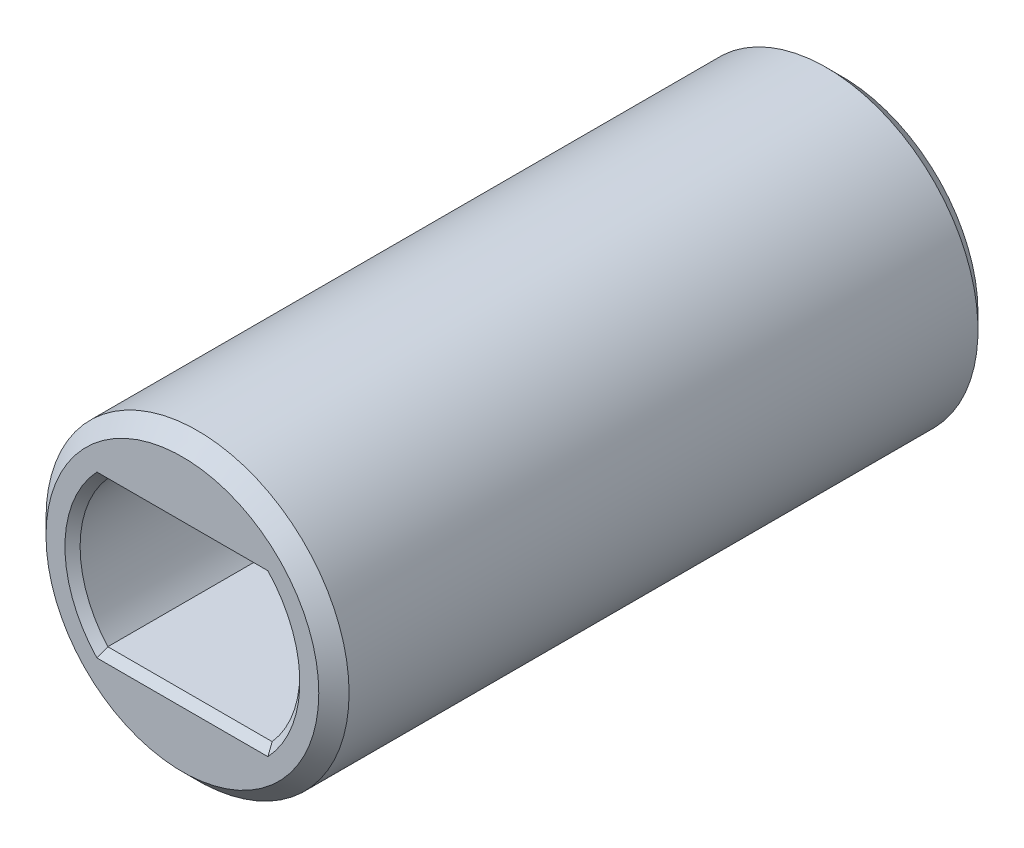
ISO-10303-21;
HEADER;
FILE_DESCRIPTION(('STEP AP214'),'2;1');
FILE_NAME('part.step','',(''),(''),'','','');
FILE_SCHEMA(('AUTOMOTIVE_DESIGN { 1 0 10303 214 1 1 1 1 }'));
ENDSEC;
DATA;
#1=APPLICATION_CONTEXT('core data for automotive mechanical design processes');
#2=APPLICATION_PROTOCOL_DEFINITION('international standard','automotive_design',2000,#1);
#3=PRODUCT_CONTEXT('',#1,'mechanical');
#4=PRODUCT('Part','Part','',(#3));
#5=PRODUCT_RELATED_PRODUCT_CATEGORY('part','',(#4));
#6=PRODUCT_DEFINITION_FORMATION('','',#4);
#7=PRODUCT_DEFINITION_CONTEXT('part definition',#1,'design');
#8=PRODUCT_DEFINITION('design','',#6,#7);
#9=PRODUCT_DEFINITION_SHAPE('','',#8);
#10=(LENGTH_UNIT() NAMED_UNIT(*) SI_UNIT(.MILLI.,.METRE.));
#11=(NAMED_UNIT(*) PLANE_ANGLE_UNIT() SI_UNIT($,.RADIAN.));
#12=(NAMED_UNIT(*) SI_UNIT($,.STERADIAN.) SOLID_ANGLE_UNIT());
#13=UNCERTAINTY_MEASURE_WITH_UNIT(LENGTH_MEASURE(1.E-05),#10,'distance_accuracy_value','');
#14=(GEOMETRIC_REPRESENTATION_CONTEXT(3) GLOBAL_UNCERTAINTY_ASSIGNED_CONTEXT((#13)) GLOBAL_UNIT_ASSIGNED_CONTEXT((#10,
#11,#12)) REPRESENTATION_CONTEXT('',''));
#15=CARTESIAN_POINT('',(0.,0.,0.));
#16=DIRECTION('',(0.,0.,1.));
#17=DIRECTION('',(1.,0.,0.));
#18=AXIS2_PLACEMENT_3D('',#15,#16,#17);
#19=CARTESIAN_POINT('',(0.,0.,-0.999999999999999));
#20=DIRECTION('',(0.,0.,-1.));
#21=DIRECTION('',(-1.,0.,0.));
#22=AXIS2_PLACEMENT_3D('',#19,#20,#21);
#23=CYLINDRICAL_SURFACE('',#22,3.);
#24=CARTESIAN_POINT('',(0.,0.,-8.8));
#25=DIRECTION('',(0.,0.,-1.));
#26=DIRECTION('',(-1.,0.,0.));
#27=AXIS2_PLACEMENT_3D('',#24,#25,#26);
#28=CIRCLE('',#27,3.);
#29=CARTESIAN_POINT('',(-3.,0.,-8.8));
#30=VERTEX_POINT('',#29);
#31=EDGE_CURVE('E209',#30,#30,#28,.T.);
#32=ORIENTED_EDGE('',*,*,#31,.T.);
#33=EDGE_LOOP('',(#32));
#34=FACE_BOUND('',#33,.T.);
#35=DIRECTION('',(0.,0.,-1.));
#36=VECTOR('',#35,1.);
#37=CARTESIAN_POINT('',(-0.4,-2.9732137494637,-0.999999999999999));
#38=LINE('',#37,#36);
#39=CARTESIAN_POINT('',(-0.4,-2.9732137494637,-6.8));
#40=VERTEX_POINT('',#39);
#41=CARTESIAN_POINT('',(-0.4,-2.9732137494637,-0.999999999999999));
#42=VERTEX_POINT('',#41);
#43=EDGE_CURVE('E151',#40,#42,#38,.F.);
#44=ORIENTED_EDGE('',*,*,#43,.F.);
#45=CARTESIAN_POINT('',(0.,0.,-7.2));
#46=DIRECTION('',(0.707106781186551,0.,0.707106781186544));
#47=DIRECTION('',(0.707106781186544,0.,-0.707106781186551));
#48=AXIS2_PLACEMENT_3D('',#45,#46,#47);
#49=ELLIPSE('',#48,4.2426406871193,3.);
#50=CARTESIAN_POINT('',(-0.200000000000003,-2.99332590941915,-7.));
#51=VERTEX_POINT('',#50);
#52=EDGE_CURVE('E188',#40,#51,#49,.T.);
#53=ORIENTED_EDGE('',*,*,#52,.T.);
#54=CARTESIAN_POINT('',(0.,0.,-7.));
#55=DIRECTION('',(0.,0.,1.));
#56=DIRECTION('',(1.,0.,0.));
#57=AXIS2_PLACEMENT_3D('',#54,#55,#56);
#58=CIRCLE('',#57,3.);
#59=CARTESIAN_POINT('',(0.200000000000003,-2.99332590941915,-7.));
#60=VERTEX_POINT('',#59);
#61=EDGE_CURVE('E175',#60,#51,#58,.F.);
#62=ORIENTED_EDGE('',*,*,#61,.F.);
#63=CARTESIAN_POINT('',(0.,0.,-7.2));
#64=DIRECTION('',(-0.707106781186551,0.,0.707106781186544));
#65=DIRECTION('',(-0.707106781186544,0.,-0.707106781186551));
#66=AXIS2_PLACEMENT_3D('',#63,#64,#65);
#67=ELLIPSE('',#66,4.2426406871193,3.);
#68=CARTESIAN_POINT('',(0.4,-2.9732137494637,-6.8));
#69=VERTEX_POINT('',#68);
#70=EDGE_CURVE('E140',#60,#69,#67,.T.);
#71=ORIENTED_EDGE('',*,*,#70,.T.);
#72=DIRECTION('',(0.,0.,-1.));
#73=VECTOR('',#72,1.);
#74=CARTESIAN_POINT('',(0.4,-2.9732137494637,-0.999999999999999));
#75=LINE('',#74,#73);
#76=CARTESIAN_POINT('',(0.4,-2.9732137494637,-0.999999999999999));
#77=VERTEX_POINT('',#76);
#78=EDGE_CURVE('E126',#77,#69,#75,.T.);
#79=ORIENTED_EDGE('',*,*,#78,.F.);
#80=CARTESIAN_POINT('',(0.,0.,-0.999999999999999));
#81=DIRECTION('',(0.,0.,-1.));
#82=DIRECTION('',(-1.,0.,0.));
#83=AXIS2_PLACEMENT_3D('',#80,#81,#82);
#84=CIRCLE('',#83,3.);
#85=CARTESIAN_POINT('',(0.4,2.9732137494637,-0.999999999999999));
#86=VERTEX_POINT('',#85);
#87=EDGE_CURVE('E138',#86,#77,#84,.T.);
#88=ORIENTED_EDGE('',*,*,#87,.F.);
#89=DIRECTION('',(0.,0.,-1.));
#90=VECTOR('',#89,1.);
#91=CARTESIAN_POINT('',(0.4,2.9732137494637,-0.999999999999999));
#92=LINE('',#91,#90);
#93=CARTESIAN_POINT('',(0.4,2.9732137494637,-6.8));
#94=VERTEX_POINT('',#93);
#95=EDGE_CURVE('E129',#94,#86,#92,.F.);
#96=ORIENTED_EDGE('',*,*,#95,.F.);
#97=CARTESIAN_POINT('',(0.,0.,-7.2));
#98=DIRECTION('',(-0.707106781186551,0.,0.707106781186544));
#99=DIRECTION('',(-0.707106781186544,0.,-0.707106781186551));
#100=AXIS2_PLACEMENT_3D('',#97,#98,#99);
#101=ELLIPSE('',#100,4.2426406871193,3.);
#102=CARTESIAN_POINT('',(0.200000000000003,2.99332590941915,-7.));
#103=VERTEX_POINT('',#102);
#104=EDGE_CURVE('E191',#94,#103,#101,.T.);
#105=ORIENTED_EDGE('',*,*,#104,.T.);
#106=CARTESIAN_POINT('',(-0.200000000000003,2.99332590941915,-7.));
#107=VERTEX_POINT('',#106);
#108=EDGE_CURVE('E172',#107,#103,#58,.F.);
#109=ORIENTED_EDGE('',*,*,#108,.F.);
#110=CARTESIAN_POINT('',(0.,0.,-7.2));
#111=DIRECTION('',(0.707106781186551,0.,0.707106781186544));
#112=DIRECTION('',(0.707106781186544,0.,-0.707106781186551));
#113=AXIS2_PLACEMENT_3D('',#110,#111,#112);
#114=ELLIPSE('',#113,4.2426406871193,3.);
#115=CARTESIAN_POINT('',(-0.4,2.9732137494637,-6.8));
#116=VERTEX_POINT('',#115);
#117=EDGE_CURVE('E186',#107,#116,#114,.T.);
#118=ORIENTED_EDGE('',*,*,#117,.T.);
#119=DIRECTION('',(0.,0.,-1.));
#120=VECTOR('',#119,1.);
#121=CARTESIAN_POINT('',(-0.4,2.9732137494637,-0.999999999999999));
#122=LINE('',#121,#120);
#123=CARTESIAN_POINT('',(-0.4,2.9732137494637,-0.999999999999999));
#124=VERTEX_POINT('',#123);
#125=EDGE_CURVE('E329',#124,#116,#122,.T.);
#126=ORIENTED_EDGE('',*,*,#125,.F.);
#127=EDGE_CURVE('E145',#42,#124,#84,.T.);
#128=ORIENTED_EDGE('',*,*,#127,.F.);
#129=EDGE_LOOP('',(#44,#53,#62,#71,#79,#88,#96,#105,#109,#118,#126,#128));
#130=FACE_BOUND('',#129,.T.);
#131=ADVANCED_FACE('F33',(#34,#130),#23,.F.);
#132=CARTESIAN_POINT('',(0.,0.,-0.999999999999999));
#133=DIRECTION('',(0.,0.,-1.));
#134=DIRECTION('',(-1.,0.,0.));
#135=AXIS2_PLACEMENT_3D('',#132,#133,#134);
#136=PLANE('',#135);
#137=ORIENTED_EDGE('',*,*,#127,.T.);
#138=DIRECTION('',(0.,-1.,0.));
#139=VECTOR('',#138,1.);
#140=CARTESIAN_POINT('',(-0.4,0.,-0.999999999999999));
#141=LINE('',#140,#139);
#142=EDGE_CURVE('E133',#124,#42,#141,.T.);
#143=ORIENTED_EDGE('',*,*,#142,.T.);
#144=EDGE_LOOP('',(#137,#143));
#145=FACE_BOUND('',#144,.T.);
#146=ADVANCED_FACE('F270',(#145),#136,.T.);
#147=ORIENTED_EDGE('',*,*,#87,.T.);
#148=DIRECTION('',(0.,1.,0.));
#149=VECTOR('',#148,1.);
#150=CARTESIAN_POINT('',(0.4,0.,-0.999999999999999));
#151=LINE('',#150,#149);
#152=EDGE_CURVE('E123',#77,#86,#151,.T.);
#153=ORIENTED_EDGE('',*,*,#152,.T.);
#154=EDGE_LOOP('',(#147,#153));
#155=FACE_BOUND('',#154,.T.);
#156=ADVANCED_FACE('F143',(#155),#136,.T.);
#157=CARTESIAN_POINT('',(0.,0.,8.4));
#158=DIRECTION('',(0.,0.,1.));
#159=DIRECTION('',(1.,0.,0.));
#160=AXIS2_PLACEMENT_3D('',#157,#158,#159);
#161=PLANE('',#160);
#162=CARTESIAN_POINT('',(0.,0.,8.4));
#163=DIRECTION('',(0.,0.,1.));
#164=DIRECTION('',(1.,0.,0.));
#165=AXIS2_PLACEMENT_3D('',#162,#163,#164);
#166=CIRCLE('',#165,3.60000000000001);
#167=CARTESIAN_POINT('',(3.60000000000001,0.,8.4));
#168=VERTEX_POINT('',#167);
#169=EDGE_CURVE('E11',#168,#168,#166,.T.);
#170=ORIENTED_EDGE('',*,*,#169,.T.);
#171=EDGE_LOOP('',(#170));
#172=FACE_BOUND('',#171,.T.);
#173=DIRECTION('',(1.,0.,0.));
#174=VECTOR('',#173,1.);
#175=CARTESIAN_POINT('',(0.,2.125,8.4));
#176=LINE('',#175,#174);
#177=CARTESIAN_POINT('',(-2.25707221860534,2.125,8.4));
#178=VERTEX_POINT('',#177);
#179=CARTESIAN_POINT('',(2.25707221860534,2.125,8.4));
#180=VERTEX_POINT('',#179);
#181=EDGE_CURVE('E198',#178,#180,#176,.T.);
#182=ORIENTED_EDGE('',*,*,#181,.T.);
#183=CARTESIAN_POINT('',(0.,0.,8.4));
#184=DIRECTION('',(0.,0.,1.));
#185=DIRECTION('',(1.,0.,0.));
#186=AXIS2_PLACEMENT_3D('',#183,#184,#185);
#187=CIRCLE('',#186,3.1);
#188=CARTESIAN_POINT('',(2.25707221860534,-2.125,8.4));
#189=VERTEX_POINT('',#188);
#190=EDGE_CURVE('E202',#180,#189,#187,.F.);
#191=ORIENTED_EDGE('',*,*,#190,.T.);
#192=DIRECTION('',(-1.,0.,0.));
#193=VECTOR('',#192,1.);
#194=CARTESIAN_POINT('',(0.,-2.125,8.4));
#195=LINE('',#194,#193);
#196=CARTESIAN_POINT('',(-2.25707221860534,-2.125,8.4));
#197=VERTEX_POINT('',#196);
#198=EDGE_CURVE('E200',#189,#197,#195,.T.);
#199=ORIENTED_EDGE('',*,*,#198,.T.);
#200=CARTESIAN_POINT('',(0.,0.,8.4));
#201=DIRECTION('',(0.,0.,1.));
#202=DIRECTION('',(1.,0.,0.));
#203=AXIS2_PLACEMENT_3D('',#200,#201,#202);
#204=CIRCLE('',#203,3.1);
#205=EDGE_CURVE('E196',#197,#178,#204,.F.);
#206=ORIENTED_EDGE('',*,*,#205,.T.);
#207=EDGE_LOOP('',(#182,#191,#199,#206));
#208=FACE_BOUND('',#207,.T.);
#209=ADVANCED_FACE('F304',(#172,#208),#161,.T.);
#210=CARTESIAN_POINT('',(0.,0.,8.4));
#211=DIRECTION('',(0.,0.,-1.));
#212=DIRECTION('',(-1.,0.,0.));
#213=AXIS2_PLACEMENT_3D('',#210,#211,#212);
#214=CYLINDRICAL_SURFACE('',#213,4.);
#215=CARTESIAN_POINT('',(0.,0.,-8.6));
#216=DIRECTION('',(0.,0.,-1.));
#217=DIRECTION('',(-1.,0.,0.));
#218=AXIS2_PLACEMENT_3D('',#215,#216,#217);
#219=CIRCLE('',#218,4.);
#220=CARTESIAN_POINT('',(-4.,0.,-8.6));
#221=VERTEX_POINT('',#220);
#222=EDGE_CURVE('E41',#221,#221,#219,.F.);
#223=ORIENTED_EDGE('',*,*,#222,.T.);
#224=EDGE_LOOP('',(#223));
#225=FACE_BOUND('',#224,.T.);
#226=CARTESIAN_POINT('',(0.,0.,8.00000000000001));
#227=DIRECTION('',(0.,0.,1.));
#228=DIRECTION('',(1.,0.,0.));
#229=AXIS2_PLACEMENT_3D('',#226,#227,#228);
#230=CIRCLE('',#229,4.);
#231=CARTESIAN_POINT('',(4.,0.,8.00000000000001));
#232=VERTEX_POINT('',#231);
#233=EDGE_CURVE('E499',#232,#232,#230,.F.);
#234=ORIENTED_EDGE('',*,*,#233,.T.);
#235=EDGE_LOOP('',(#234));
#236=FACE_BOUND('',#235,.T.);
#237=ADVANCED_FACE('F303',(#225,#236),#214,.T.);
#238=CARTESIAN_POINT('',(0.,0.,8.4));
#239=DIRECTION('',(0.,0.,-1.));
#240=DIRECTION('',(-1.,0.,0.));
#241=AXIS2_PLACEMENT_3D('',#238,#239,#240);
#242=CYLINDRICAL_SURFACE('',#241,2.9);
#243=DIRECTION('',(0.,0.,-1.));
#244=VECTOR('',#243,1.);
#245=CARTESIAN_POINT('',(-2.1689571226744,1.925,8.4));
#246=LINE('',#245,#244);
#247=CARTESIAN_POINT('',(-2.1689571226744,1.925,8.2));
#248=VERTEX_POINT('',#247);
#249=CARTESIAN_POINT('',(-2.1689571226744,1.925,0.));
#250=VERTEX_POINT('',#249);
#251=EDGE_CURVE('E163',#248,#250,#246,.T.);
#252=ORIENTED_EDGE('',*,*,#251,.F.);
#253=CARTESIAN_POINT('',(0.,0.,8.2));
#254=DIRECTION('',(0.,0.,1.));
#255=DIRECTION('',(1.,0.,0.));
#256=AXIS2_PLACEMENT_3D('',#253,#254,#255);
#257=CIRCLE('',#256,2.9);
#258=CARTESIAN_POINT('',(-2.1689571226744,-1.925,8.2));
#259=VERTEX_POINT('',#258);
#260=EDGE_CURVE('E55',#248,#259,#257,.T.);
#261=ORIENTED_EDGE('',*,*,#260,.T.);
#262=DIRECTION('',(0.,0.,-1.));
#263=VECTOR('',#262,1.);
#264=CARTESIAN_POINT('',(-2.1689571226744,-1.925,8.4));
#265=LINE('',#264,#263);
#266=CARTESIAN_POINT('',(-2.1689571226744,-1.925,0.));
#267=VERTEX_POINT('',#266);
#268=EDGE_CURVE('E134',#259,#267,#265,.T.);
#269=ORIENTED_EDGE('',*,*,#268,.T.);
#270=CARTESIAN_POINT('',(0.,0.,0.));
#271=DIRECTION('',(0.,0.,1.));
#272=DIRECTION('',(1.,0.,0.));
#273=AXIS2_PLACEMENT_3D('',#270,#271,#272);
#274=CIRCLE('',#273,2.9);
#275=EDGE_CURVE('E144',#250,#267,#274,.T.);
#276=ORIENTED_EDGE('',*,*,#275,.F.);
#277=EDGE_LOOP('',(#252,#261,#269,#276));
#278=FACE_BOUND('',#277,.T.);
#279=ADVANCED_FACE('F299',(#278),#242,.F.);
#280=CARTESIAN_POINT('',(-2.1689571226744,-1.925,8.4));
#281=DIRECTION('',(0.,1.,0.));
#282=DIRECTION('',(-1.,0.,0.));
#283=AXIS2_PLACEMENT_3D('',#280,#281,#282);
#284=PLANE('',#283);
#285=ORIENTED_EDGE('',*,*,#268,.F.);
#286=DIRECTION('',(1.,0.,0.));
#287=VECTOR('',#286,1.);
#288=CARTESIAN_POINT('',(-2.1689571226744,-1.925,8.2));
#289=LINE('',#288,#287);
#290=CARTESIAN_POINT('',(2.1689571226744,-1.925,8.2));
#291=VERTEX_POINT('',#290);
#292=EDGE_CURVE('E205',#259,#291,#289,.T.);
#293=ORIENTED_EDGE('',*,*,#292,.T.);
#294=DIRECTION('',(0.,0.,-1.));
#295=VECTOR('',#294,1.);
#296=CARTESIAN_POINT('',(2.1689571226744,-1.925,8.4));
#297=LINE('',#296,#295);
#298=CARTESIAN_POINT('',(2.1689571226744,-1.925,0.));
#299=VERTEX_POINT('',#298);
#300=EDGE_CURVE('E167',#291,#299,#297,.T.);
#301=ORIENTED_EDGE('',*,*,#300,.T.);
#302=DIRECTION('',(1.,0.,0.));
#303=VECTOR('',#302,1.);
#304=CARTESIAN_POINT('',(-2.1689571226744,-1.925,0.));
#305=LINE('',#304,#303);
#306=EDGE_CURVE('E148',#267,#299,#305,.T.);
#307=ORIENTED_EDGE('',*,*,#306,.F.);
#308=EDGE_LOOP('',(#285,#293,#301,#307));
#309=FACE_BOUND('',#308,.T.);
#310=ADVANCED_FACE('F295',(#309),#284,.T.);
#311=CARTESIAN_POINT('',(0.,0.,8.4));
#312=DIRECTION('',(0.,0.,-1.));
#313=DIRECTION('',(-1.,0.,0.));
#314=AXIS2_PLACEMENT_3D('',#311,#312,#313);
#315=CYLINDRICAL_SURFACE('',#314,2.9);
#316=ORIENTED_EDGE('',*,*,#300,.F.);
#317=CARTESIAN_POINT('',(0.,0.,8.2));
#318=DIRECTION('',(0.,0.,1.));
#319=DIRECTION('',(1.,0.,0.));
#320=AXIS2_PLACEMENT_3D('',#317,#318,#319);
#321=CIRCLE('',#320,2.9);
#322=CARTESIAN_POINT('',(2.1689571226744,1.925,8.2));
#323=VERTEX_POINT('',#322);
#324=EDGE_CURVE('E193',#291,#323,#321,.T.);
#325=ORIENTED_EDGE('',*,*,#324,.T.);
#326=DIRECTION('',(0.,0.,-1.));
#327=VECTOR('',#326,1.);
#328=CARTESIAN_POINT('',(2.1689571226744,1.925,8.4));
#329=LINE('',#328,#327);
#330=CARTESIAN_POINT('',(2.1689571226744,1.925,0.));
#331=VERTEX_POINT('',#330);
#332=EDGE_CURVE('E165',#323,#331,#329,.T.);
#333=ORIENTED_EDGE('',*,*,#332,.T.);
#334=CARTESIAN_POINT('',(0.,0.,0.));
#335=DIRECTION('',(0.,0.,1.));
#336=DIRECTION('',(1.,0.,0.));
#337=AXIS2_PLACEMENT_3D('',#334,#335,#336);
#338=CIRCLE('',#337,2.9);
#339=EDGE_CURVE('E157',#299,#331,#338,.T.);
#340=ORIENTED_EDGE('',*,*,#339,.F.);
#341=EDGE_LOOP('',(#316,#325,#333,#340));
#342=FACE_BOUND('',#341,.T.);
#343=ADVANCED_FACE('F292',(#342),#315,.F.);
#344=CARTESIAN_POINT('',(-2.1689571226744,1.925,8.4));
#345=DIRECTION('',(0.,-1.,0.));
#346=DIRECTION('',(1.,0.,0.));
#347=AXIS2_PLACEMENT_3D('',#344,#345,#346);
#348=PLANE('',#347);
#349=ORIENTED_EDGE('',*,*,#332,.F.);
#350=DIRECTION('',(-1.,0.,0.));
#351=VECTOR('',#350,1.);
#352=CARTESIAN_POINT('',(-2.1689571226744,1.925,8.2));
#353=LINE('',#352,#351);
#354=EDGE_CURVE('E48',#323,#248,#353,.T.);
#355=ORIENTED_EDGE('',*,*,#354,.T.);
#356=ORIENTED_EDGE('',*,*,#251,.T.);
#357=DIRECTION('',(-1.,0.,0.));
#358=VECTOR('',#357,1.);
#359=CARTESIAN_POINT('',(-2.1689571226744,1.925,0.));
#360=LINE('',#359,#358);
#361=EDGE_CURVE('E160',#331,#250,#360,.T.);
#362=ORIENTED_EDGE('',*,*,#361,.F.);
#363=EDGE_LOOP('',(#349,#355,#356,#362));
#364=FACE_BOUND('',#363,.T.);
#365=ADVANCED_FACE('F288',(#364),#348,.T.);
#366=CARTESIAN_POINT('',(0.,0.,0.));
#367=DIRECTION('',(0.,0.,-1.));
#368=DIRECTION('',(-1.,0.,0.));
#369=AXIS2_PLACEMENT_3D('',#366,#367,#368);
#370=PLANE('',#369);
#371=ORIENTED_EDGE('',*,*,#275,.T.);
#372=ORIENTED_EDGE('',*,*,#306,.T.);
#373=ORIENTED_EDGE('',*,*,#339,.T.);
#374=ORIENTED_EDGE('',*,*,#361,.T.);
#375=EDGE_LOOP('',(#371,#372,#373,#374));
#376=FACE_BOUND('',#375,.T.);
#377=ADVANCED_FACE('F284',(#376),#370,.F.);
#378=CARTESIAN_POINT('',(0.,0.,-9.));
#379=DIRECTION('',(0.,0.,-1.));
#380=DIRECTION('',(-1.,0.,0.));
#381=AXIS2_PLACEMENT_3D('',#378,#379,#380);
#382=PLANE('',#381);
#383=CARTESIAN_POINT('',(0.,0.,-9.));
#384=DIRECTION('',(0.,0.,-1.));
#385=DIRECTION('',(-1.,0.,0.));
#386=AXIS2_PLACEMENT_3D('',#383,#384,#385);
#387=CIRCLE('',#386,3.6);
#388=CARTESIAN_POINT('',(-3.6,0.,-9.));
#389=VERTEX_POINT('',#388);
#390=EDGE_CURVE('E215',#389,#389,#387,.T.);
#391=ORIENTED_EDGE('',*,*,#390,.T.);
#392=EDGE_LOOP('',(#391));
#393=FACE_BOUND('',#392,.T.);
#394=CARTESIAN_POINT('',(0.,0.,-9.));
#395=DIRECTION('',(0.,0.,-1.));
#396=DIRECTION('',(-1.,0.,0.));
#397=AXIS2_PLACEMENT_3D('',#394,#395,#396);
#398=CIRCLE('',#397,3.2);
#399=CARTESIAN_POINT('',(-3.2,0.,-9.));
#400=VERTEX_POINT('',#399);
#401=EDGE_CURVE('E212',#400,#400,#398,.F.);
#402=ORIENTED_EDGE('',*,*,#401,.T.);
#403=EDGE_LOOP('',(#402));
#404=FACE_BOUND('',#403,.T.);
#405=ADVANCED_FACE('F280',(#393,#404),#382,.T.);
#406=CARTESIAN_POINT('',(0.,0.,-7.));
#407=DIRECTION('',(0.,0.,1.));
#408=DIRECTION('',(1.,0.,0.));
#409=AXIS2_PLACEMENT_3D('',#406,#407,#408);
#410=PLANE('',#409);
#411=ORIENTED_EDGE('',*,*,#61,.T.);
#412=DIRECTION('',(0.,1.,0.));
#413=VECTOR('',#412,1.);
#414=CARTESIAN_POINT('',(-0.200000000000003,0.,-7.));
#415=LINE('',#414,#413);
#416=EDGE_CURVE('E179',#51,#107,#415,.T.);
#417=ORIENTED_EDGE('',*,*,#416,.T.);
#418=ORIENTED_EDGE('',*,*,#108,.T.);
#419=DIRECTION('',(0.,-1.,0.));
#420=VECTOR('',#419,1.);
#421=CARTESIAN_POINT('',(0.200000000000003,0.,-7.));
#422=LINE('',#421,#420);
#423=EDGE_CURVE('E176',#103,#60,#422,.T.);
#424=ORIENTED_EDGE('',*,*,#423,.T.);
#425=EDGE_LOOP('',(#411,#417,#418,#424));
#426=FACE_BOUND('',#425,.T.);
#427=ADVANCED_FACE('F283',(#426),#410,.F.);
#428=CARTESIAN_POINT('',(-0.4,-3.97994974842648,-7.));
#429=DIRECTION('',(1.,0.,0.));
#430=DIRECTION('',(0.,0.,-1.));
#431=AXIS2_PLACEMENT_3D('',#428,#429,#430);
#432=PLANE('',#431);
#433=ORIENTED_EDGE('',*,*,#125,.T.);
#434=DIRECTION('',(0.,-1.,0.));
#435=VECTOR('',#434,1.);
#436=CARTESIAN_POINT('',(-0.4,-3.97994974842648,-6.8));
#437=LINE('',#436,#435);
#438=EDGE_CURVE('E182',#116,#40,#437,.T.);
#439=ORIENTED_EDGE('',*,*,#438,.T.);
#440=ORIENTED_EDGE('',*,*,#43,.T.);
#441=ORIENTED_EDGE('',*,*,#142,.F.);
#442=EDGE_LOOP('',(#433,#439,#440,#441));
#443=FACE_BOUND('',#442,.T.);
#444=ADVANCED_FACE('F331',(#443),#432,.F.);
#445=CARTESIAN_POINT('',(0.4,-3.97994974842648,-7.));
#446=DIRECTION('',(-1.,0.,0.));
#447=DIRECTION('',(0.,0.,1.));
#448=AXIS2_PLACEMENT_3D('',#445,#446,#447);
#449=PLANE('',#448);
#450=ORIENTED_EDGE('',*,*,#78,.T.);
#451=DIRECTION('',(0.,1.,0.));
#452=VECTOR('',#451,1.);
#453=CARTESIAN_POINT('',(0.4,-3.97994974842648,-6.8));
#454=LINE('',#453,#452);
#455=EDGE_CURVE('E184',#69,#94,#454,.T.);
#456=ORIENTED_EDGE('',*,*,#455,.T.);
#457=ORIENTED_EDGE('',*,*,#95,.T.);
#458=ORIENTED_EDGE('',*,*,#152,.F.);
#459=EDGE_LOOP('',(#450,#456,#457,#458));
#460=FACE_BOUND('',#459,.T.);
#461=ADVANCED_FACE('F125',(#460),#449,.F.);
#462=CARTESIAN_POINT('',(-0.200000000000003,0.,-7.));
#463=DIRECTION('',(0.707106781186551,0.,0.707106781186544));
#464=DIRECTION('',(0.,1.,0.));
#465=AXIS2_PLACEMENT_3D('',#462,#463,#464);
#466=PLANE('',#465);
#467=ORIENTED_EDGE('',*,*,#52,.F.);
#468=ORIENTED_EDGE('',*,*,#438,.F.);
#469=ORIENTED_EDGE('',*,*,#117,.F.);
#470=ORIENTED_EDGE('',*,*,#416,.F.);
#471=EDGE_LOOP('',(#467,#468,#469,#470));
#472=FACE_BOUND('',#471,.T.);
#473=ADVANCED_FACE('F311',(#472),#466,.F.);
#474=CARTESIAN_POINT('',(0.200000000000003,0.,-7.));
#475=DIRECTION('',(-0.707106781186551,0.,0.707106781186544));
#476=DIRECTION('',(0.,-1.,0.));
#477=AXIS2_PLACEMENT_3D('',#474,#475,#476);
#478=PLANE('',#477);
#479=ORIENTED_EDGE('',*,*,#104,.F.);
#480=ORIENTED_EDGE('',*,*,#455,.F.);
#481=ORIENTED_EDGE('',*,*,#70,.F.);
#482=ORIENTED_EDGE('',*,*,#423,.F.);
#483=EDGE_LOOP('',(#479,#480,#481,#482));
#484=FACE_BOUND('',#483,.T.);
#485=ADVANCED_FACE('F254',(#484),#478,.F.);
#486=CARTESIAN_POINT('',(0.,0.,8.2));
#487=DIRECTION('',(0.,0.,1.));
#488=DIRECTION('',(1.,0.,0.));
#489=AXIS2_PLACEMENT_3D('',#486,#487,#488);
#490=CONICAL_SURFACE('',#489,2.9,0.785398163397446);
#491=CARTESIAN_POINT('',(-2.1689571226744,1.925,8.2));
#492=CARTESIAN_POINT('',(-2.18390946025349,1.95827463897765,8.23327463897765));
#493=CARTESIAN_POINT('',(-2.19872855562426,1.99157862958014,8.26657862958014));
#494=CARTESIAN_POINT('',(-2.22810025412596,2.05824529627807,8.33324529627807));
#495=CARTESIAN_POINT('',(-2.24265285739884,2.09160797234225,8.36660797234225));
#496=CARTESIAN_POINT('',(-2.25707221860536,2.125,8.4));
#497=B_SPLINE_CURVE_WITH_KNOTS('',3,(#491,#492,#493,#494,#495,#496),.UNSPECIFIED.,.F.,.F.,(4,2,
4),(0.,0.148125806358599,0.296251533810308),.UNSPECIFIED.);
#498=EDGE_CURVE('E240',#178,#248,#497,.F.);
#499=ORIENTED_EDGE('',*,*,#498,.F.);
#500=ORIENTED_EDGE('',*,*,#205,.F.);
#501=CARTESIAN_POINT('',(-2.25707221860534,-2.125,8.4));
#502=CARTESIAN_POINT('',(-2.24265285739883,-2.09160797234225,8.36660797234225));
#503=CARTESIAN_POINT('',(-2.22810025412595,-2.05824529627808,8.33324529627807));
#504=CARTESIAN_POINT('',(-2.19872855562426,-1.99157862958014,8.26657862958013));
#505=CARTESIAN_POINT('',(-2.1839094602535,-1.95827463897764,8.23327463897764));
#506=CARTESIAN_POINT('',(-2.16895712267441,-1.925,8.2));
#507=B_SPLINE_CURVE_WITH_KNOTS('',3,(#501,#502,#503,#504,#505,#506),.UNSPECIFIED.,.F.,.F.,(4,2,
4),(0.,0.148125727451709,0.296251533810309),.UNSPECIFIED.);
#508=EDGE_CURVE('E141',#259,#197,#507,.F.);
#509=ORIENTED_EDGE('',*,*,#508,.F.);
#510=ORIENTED_EDGE('',*,*,#260,.F.);
#511=EDGE_LOOP('',(#499,#500,#509,#510));
#512=FACE_BOUND('',#511,.T.);
#513=ADVANCED_FACE('F250',(#512),#490,.F.);
#514=CARTESIAN_POINT('',(-2.1689571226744,-1.925,8.2));
#515=DIRECTION('',(0.,-0.707106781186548,-0.707106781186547));
#516=DIRECTION('',(1.,0.,0.));
#517=AXIS2_PLACEMENT_3D('',#514,#515,#516);
#518=PLANE('',#517);
#519=ORIENTED_EDGE('',*,*,#508,.T.);
#520=ORIENTED_EDGE('',*,*,#198,.F.);
#521=CARTESIAN_POINT('',(2.25707221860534,-2.125,8.4));
#522=CARTESIAN_POINT('',(2.24265285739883,-2.09160797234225,8.36660797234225));
#523=CARTESIAN_POINT('',(2.22810025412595,-2.05824529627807,8.33324529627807));
#524=CARTESIAN_POINT('',(2.19872855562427,-1.99157862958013,8.26657862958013));
#525=CARTESIAN_POINT('',(2.1839094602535,-1.95827463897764,8.23327463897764));
#526=CARTESIAN_POINT('',(2.16895712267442,-1.925,8.2));
#527=B_SPLINE_CURVE_WITH_KNOTS('',3,(#521,#522,#523,#524,#525,#526),.UNSPECIFIED.,.F.,.F.,(4,2,
4),(0.,0.148125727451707,0.296251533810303),.UNSPECIFIED.);
#528=EDGE_CURVE('E223',#291,#189,#527,.F.);
#529=ORIENTED_EDGE('',*,*,#528,.F.);
#530=ORIENTED_EDGE('',*,*,#292,.F.);
#531=EDGE_LOOP('',(#519,#520,#529,#530));
#532=FACE_BOUND('',#531,.T.);
#533=ADVANCED_FACE('F235',(#532),#518,.F.);
#534=CARTESIAN_POINT('',(-2.1689571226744,1.925,8.2));
#535=DIRECTION('',(0.,0.707106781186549,-0.707106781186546));
#536=DIRECTION('',(-1.,0.,0.));
#537=AXIS2_PLACEMENT_3D('',#534,#535,#536);
#538=PLANE('',#537);
#539=ORIENTED_EDGE('',*,*,#498,.T.);
#540=ORIENTED_EDGE('',*,*,#354,.F.);
#541=CARTESIAN_POINT('',(2.1689571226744,1.925,8.2));
#542=CARTESIAN_POINT('',(2.18390946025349,1.95827463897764,8.23327463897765));
#543=CARTESIAN_POINT('',(2.19872855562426,1.99157862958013,8.26657862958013));
#544=CARTESIAN_POINT('',(2.22810025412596,2.05824529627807,8.33324529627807));
#545=CARTESIAN_POINT('',(2.24265285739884,2.09160797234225,8.36660797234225));
#546=CARTESIAN_POINT('',(2.25707221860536,2.12499999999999,8.4));
#547=B_SPLINE_CURVE_WITH_KNOTS('',3,(#541,#542,#543,#544,#545,#546),.UNSPECIFIED.,.F.,.F.,(4,2,
4),(0.,0.148125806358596,0.296251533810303),.UNSPECIFIED.);
#548=EDGE_CURVE('E216',#180,#323,#547,.F.);
#549=ORIENTED_EDGE('',*,*,#548,.F.);
#550=ORIENTED_EDGE('',*,*,#181,.F.);
#551=EDGE_LOOP('',(#539,#540,#549,#550));
#552=FACE_BOUND('',#551,.T.);
#553=ADVANCED_FACE('F232',(#552),#538,.F.);
#554=CARTESIAN_POINT('',(0.,0.,8.2));
#555=DIRECTION('',(0.,0.,1.));
#556=DIRECTION('',(1.,0.,0.));
#557=AXIS2_PLACEMENT_3D('',#554,#555,#556);
#558=CONICAL_SURFACE('',#557,2.9,0.785398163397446);
#559=ORIENTED_EDGE('',*,*,#528,.T.);
#560=ORIENTED_EDGE('',*,*,#190,.F.);
#561=ORIENTED_EDGE('',*,*,#548,.T.);
#562=ORIENTED_EDGE('',*,*,#324,.F.);
#563=EDGE_LOOP('',(#559,#560,#561,#562));
#564=FACE_BOUND('',#563,.T.);
#565=ADVANCED_FACE('F229',(#564),#558,.F.);
#566=CARTESIAN_POINT('',(0.,0.,-8.8));
#567=DIRECTION('',(0.,0.,-1.));
#568=DIRECTION('',(-1.,0.,0.));
#569=AXIS2_PLACEMENT_3D('',#566,#567,#568);
#570=CONICAL_SURFACE('',#569,3.,0.785398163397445);
#571=ORIENTED_EDGE('',*,*,#401,.F.);
#572=EDGE_LOOP('',(#571));
#573=FACE_BOUND('',#572,.T.);
#574=ORIENTED_EDGE('',*,*,#31,.F.);
#575=EDGE_LOOP('',(#574));
#576=FACE_BOUND('',#575,.T.);
#577=ADVANCED_FACE('F256',(#573,#576),#570,.F.);
#578=CARTESIAN_POINT('',(0.,0.,-9.));
#579=DIRECTION('',(0.,0.,1.));
#580=DIRECTION('',(1.,0.,0.));
#581=AXIS2_PLACEMENT_3D('',#578,#579,#580);
#582=CONICAL_SURFACE('',#581,3.6,0.785398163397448);
#583=ORIENTED_EDGE('',*,*,#222,.F.);
#584=EDGE_LOOP('',(#583));
#585=FACE_BOUND('',#584,.T.);
#586=ORIENTED_EDGE('',*,*,#390,.F.);
#587=EDGE_LOOP('',(#586));
#588=FACE_BOUND('',#587,.T.);
#589=ADVANCED_FACE('F259',(#585,#588),#582,.T.);
#590=CARTESIAN_POINT('',(0.,0.,8.4));
#591=DIRECTION('',(0.,0.,-1.));
#592=DIRECTION('',(-1.,0.,0.));
#593=AXIS2_PLACEMENT_3D('',#590,#591,#592);
#594=CONICAL_SURFACE('',#593,3.60000000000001,0.785398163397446);
#595=ORIENTED_EDGE('',*,*,#233,.F.);
#596=EDGE_LOOP('',(#595));
#597=FACE_BOUND('',#596,.T.);
#598=ORIENTED_EDGE('',*,*,#169,.F.);
#599=EDGE_LOOP('',(#598));
#600=FACE_BOUND('',#599,.T.);
#601=ADVANCED_FACE('F35',(#597,#600),#594,.T.);
#602=CLOSED_SHELL('',(#131,#146,#156,#209,#237,#279,#310,#343,#365,#377,#405,#427,#444,#461,
#473,#485,#513,#533,#553,#565,#577,#589,#601));
#603=MANIFOLD_SOLID_BREP('B2',#602);
#604=ADVANCED_BREP_SHAPE_REPRESENTATION('',(#18,#603),#14);
#605=SHAPE_DEFINITION_REPRESENTATION(#9,#604);
ENDSEC;
END-ISO-10303-21;
